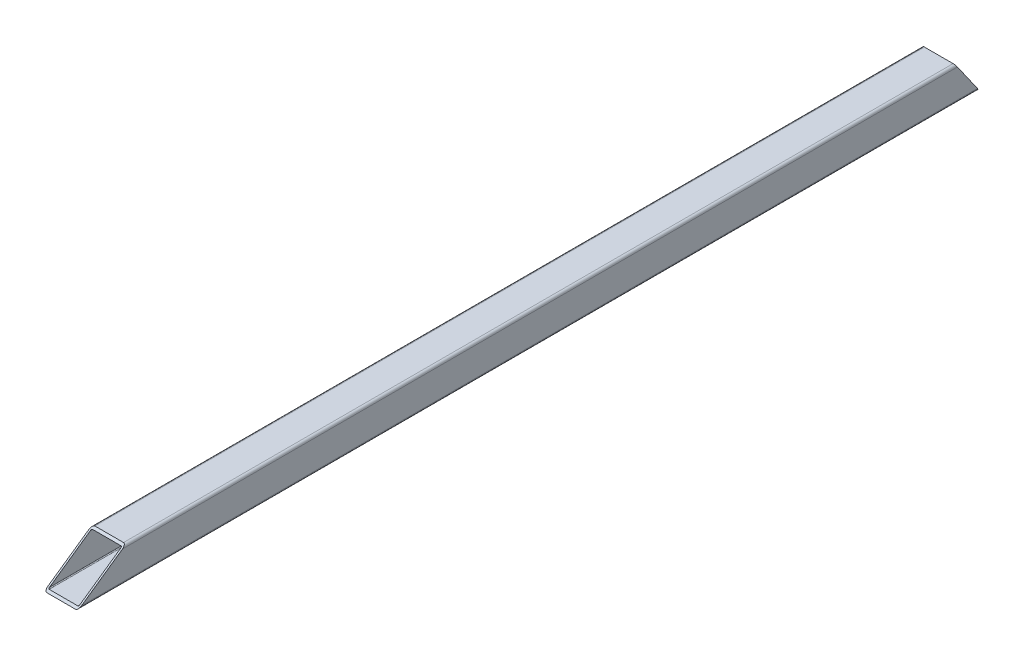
ISO-10303-21;
HEADER;
FILE_DESCRIPTION(('STEP AP214'),'2;1');
FILE_NAME('part.step','',(''),(''),'','','');
FILE_SCHEMA(('AUTOMOTIVE_DESIGN { 1 0 10303 214 1 1 1 1 }'));
ENDSEC;
DATA;
#1=APPLICATION_CONTEXT('core data for automotive mechanical design processes');
#2=APPLICATION_PROTOCOL_DEFINITION('international standard','automotive_design',2000,#1);
#3=PRODUCT_CONTEXT('',#1,'mechanical');
#4=PRODUCT('Part','Part','',(#3));
#5=PRODUCT_RELATED_PRODUCT_CATEGORY('part','',(#4));
#6=PRODUCT_DEFINITION_FORMATION('','',#4);
#7=PRODUCT_DEFINITION_CONTEXT('part definition',#1,'design');
#8=PRODUCT_DEFINITION('design','',#6,#7);
#9=PRODUCT_DEFINITION_SHAPE('','',#8);
#10=(LENGTH_UNIT() NAMED_UNIT(*) SI_UNIT(.MILLI.,.METRE.));
#11=(NAMED_UNIT(*) PLANE_ANGLE_UNIT() SI_UNIT($,.RADIAN.));
#12=(NAMED_UNIT(*) SI_UNIT($,.STERADIAN.) SOLID_ANGLE_UNIT());
#13=UNCERTAINTY_MEASURE_WITH_UNIT(LENGTH_MEASURE(1.E-05),#10,'distance_accuracy_value','');
#14=(GEOMETRIC_REPRESENTATION_CONTEXT(3) GLOBAL_UNCERTAINTY_ASSIGNED_CONTEXT((#13)) GLOBAL_UNIT_ASSIGNED_CONTEXT((#10,
#11,#12)) REPRESENTATION_CONTEXT('',''));
#15=CARTESIAN_POINT('',(0.,0.,0.));
#16=DIRECTION('',(0.,0.,1.));
#17=DIRECTION('',(1.,0.,0.));
#18=AXIS2_PLACEMENT_3D('',#15,#16,#17);
#19=CARTESIAN_POINT('',(3.,-3.,1070.));
#20=DIRECTION('',(0.,0.,-1.));
#21=DIRECTION('',(-1.,0.,0.));
#22=AXIS2_PLACEMENT_3D('',#19,#20,#21);
#23=CYLINDRICAL_SURFACE('',#22,3.);
#24=DIRECTION('',(0.,0.,-1.));
#25=VECTOR('',#24,1.);
#26=CARTESIAN_POINT('',(0.,-3.00000000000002,1070.));
#27=LINE('',#26,#25);
#28=CARTESIAN_POINT('',(0.,-2.99999999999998,1017.15852375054));
#29=VERTEX_POINT('',#28);
#30=CARTESIAN_POINT('',(0.,-3.00000000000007,25.9076789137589));
#31=VERTEX_POINT('',#30);
#32=EDGE_CURVE('E152',#29,#31,#27,.T.);
#33=ORIENTED_EDGE('',*,*,#32,.F.);
#34=CARTESIAN_POINT('',(3.,-3.,1017.15852375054));
#35=DIRECTION('',(0.,-0.819152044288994,-0.573576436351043));
#36=DIRECTION('',(0.,0.573576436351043,-0.819152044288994));
#37=AXIS2_PLACEMENT_3D('',#34,#35,#36);
#38=ELLIPSE('',#37,5.23034038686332,3.);
#39=CARTESIAN_POINT('',(3.00000000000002,0.,1012.87407973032));
#40=VERTEX_POINT('',#39);
#41=EDGE_CURVE('E136',#29,#40,#38,.T.);
#42=ORIENTED_EDGE('',*,*,#41,.T.);
#43=DIRECTION('',(0.,0.,-1.));
#44=VECTOR('',#43,1.);
#45=CARTESIAN_POINT('',(3.00000000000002,0.,1070.));
#46=LINE('',#45,#44);
#47=CARTESIAN_POINT('',(3.00000000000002,0.,28.0083015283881));
#48=VERTEX_POINT('',#47);
#49=EDGE_CURVE('E176',#40,#48,#46,.T.);
#50=ORIENTED_EDGE('',*,*,#49,.T.);
#51=CARTESIAN_POINT('',(3.,-3.,25.9076789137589));
#52=DIRECTION('',(0.,-0.573576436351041,0.819152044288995));
#53=DIRECTION('',(0.,-0.819152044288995,-0.573576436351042));
#54=AXIS2_PLACEMENT_3D('',#51,#52,#53);
#55=ELLIPSE('',#54,3.66232376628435,3.);
#56=EDGE_CURVE('E159',#48,#31,#55,.T.);
#57=ORIENTED_EDGE('',*,*,#56,.T.);
#58=EDGE_LOOP('',(#33,#42,#50,#57));
#59=FACE_BOUND('',#58,.T.);
#60=ADVANCED_FACE('F27',(#59),#23,.T.);
#61=CARTESIAN_POINT('',(0.,-3.00000000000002,1070.));
#62=DIRECTION('',(1.,0.,0.));
#63=DIRECTION('',(0.,1.,0.));
#64=AXIS2_PLACEMENT_3D('',#61,#62,#63);
#65=PLANE('',#64);
#66=DIRECTION('',(0.,0.,-1.));
#67=VECTOR('',#66,1.);
#68=CARTESIAN_POINT('',(0.,-37.,1070.));
#69=LINE('',#68,#67);
#70=CARTESIAN_POINT('',(0.,-37.,1065.71555597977));
#71=VERTEX_POINT('',#70);
#72=CARTESIAN_POINT('',(0.,-37.,2.10062261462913));
#73=VERTEX_POINT('',#72);
#74=EDGE_CURVE('E154',#71,#73,#69,.T.);
#75=ORIENTED_EDGE('',*,*,#74,.F.);
#76=DIRECTION('',(0.,-0.573576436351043,0.819152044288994));
#77=VECTOR('',#76,1.);
#78=CARTESIAN_POINT('',(0.,0.,1012.87407973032));
#79=LINE('',#78,#77);
#80=EDGE_CURVE('E139',#29,#71,#79,.T.);
#81=ORIENTED_EDGE('',*,*,#80,.F.);
#82=ORIENTED_EDGE('',*,*,#32,.T.);
#83=DIRECTION('',(0.,0.819152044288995,0.573576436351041));
#84=VECTOR('',#83,1.);
#85=CARTESIAN_POINT('',(0.,-40.,0.));
#86=LINE('',#85,#84);
#87=EDGE_CURVE('E145',#73,#31,#86,.T.);
#88=ORIENTED_EDGE('',*,*,#87,.F.);
#89=EDGE_LOOP('',(#75,#81,#82,#88));
#90=FACE_BOUND('',#89,.T.);
#91=ADVANCED_FACE('F150',(#90),#65,.F.);
#92=CARTESIAN_POINT('',(3.,-37.,1070.));
#93=DIRECTION('',(0.,0.,-1.));
#94=DIRECTION('',(-1.,0.,0.));
#95=AXIS2_PLACEMENT_3D('',#92,#93,#94);
#96=CYLINDRICAL_SURFACE('',#95,3.);
#97=DIRECTION('',(0.,0.,-1.));
#98=VECTOR('',#97,1.);
#99=CARTESIAN_POINT('',(3.00000000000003,-40.,1070.));
#100=LINE('',#99,#98);
#101=CARTESIAN_POINT('',(3.00000000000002,-40.,1070.));
#102=VERTEX_POINT('',#101);
#103=CARTESIAN_POINT('',(3.00000000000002,-40.,0.));
#104=VERTEX_POINT('',#103);
#105=EDGE_CURVE('E162',#102,#104,#100,.T.);
#106=ORIENTED_EDGE('',*,*,#105,.F.);
#107=CARTESIAN_POINT('',(3.,-37.,1065.71555597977));
#108=DIRECTION('',(0.,-0.819152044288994,-0.573576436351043));
#109=DIRECTION('',(0.,0.573576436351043,-0.819152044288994));
#110=AXIS2_PLACEMENT_3D('',#107,#108,#109);
#111=ELLIPSE('',#110,5.23034038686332,3.);
#112=EDGE_CURVE('E146',#102,#71,#111,.T.);
#113=ORIENTED_EDGE('',*,*,#112,.T.);
#114=ORIENTED_EDGE('',*,*,#74,.T.);
#115=CARTESIAN_POINT('',(3.,-37.,2.10062261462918));
#116=DIRECTION('',(0.,-0.573576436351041,0.819152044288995));
#117=DIRECTION('',(0.,-0.819152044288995,-0.573576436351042));
#118=AXIS2_PLACEMENT_3D('',#115,#116,#117);
#119=ELLIPSE('',#118,3.66232376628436,3.);
#120=EDGE_CURVE('E200',#73,#104,#119,.T.);
#121=ORIENTED_EDGE('',*,*,#120,.T.);
#122=EDGE_LOOP('',(#106,#113,#114,#121));
#123=FACE_BOUND('',#122,.T.);
#124=ADVANCED_FACE('F275',(#123),#96,.T.);
#125=CARTESIAN_POINT('',(3.00000000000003,-40.,1070.));
#126=DIRECTION('',(0.,1.,0.));
#127=DIRECTION('',(0.,0.,1.));
#128=AXIS2_PLACEMENT_3D('',#125,#126,#127);
#129=PLANE('',#128);
#130=DIRECTION('',(1.,0.,0.));
#131=VECTOR('',#130,1.);
#132=CARTESIAN_POINT('',(3.00000000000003,-40.,0.));
#133=LINE('',#132,#131);
#134=CARTESIAN_POINT('',(37.,-40.,0.));
#135=VERTEX_POINT('',#134);
#136=EDGE_CURVE('E180',#104,#135,#133,.T.);
#137=ORIENTED_EDGE('',*,*,#136,.T.);
#138=DIRECTION('',(0.,0.,-1.));
#139=VECTOR('',#138,1.);
#140=CARTESIAN_POINT('',(37.,-40.,1070.));
#141=LINE('',#140,#139);
#142=CARTESIAN_POINT('',(37.,-40.,1070.));
#143=VERTEX_POINT('',#142);
#144=EDGE_CURVE('E167',#143,#135,#141,.T.);
#145=ORIENTED_EDGE('',*,*,#144,.F.);
#146=DIRECTION('',(1.,0.,0.));
#147=VECTOR('',#146,1.);
#148=CARTESIAN_POINT('',(3.00000000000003,-40.,1070.));
#149=LINE('',#148,#147);
#150=EDGE_CURVE('E178',#102,#143,#149,.T.);
#151=ORIENTED_EDGE('',*,*,#150,.F.);
#152=ORIENTED_EDGE('',*,*,#105,.T.);
#153=EDGE_LOOP('',(#137,#145,#151,#152));
#154=FACE_BOUND('',#153,.T.);
#155=ADVANCED_FACE('F271',(#154),#129,.F.);
#156=CARTESIAN_POINT('',(37.,-37.,1070.));
#157=DIRECTION('',(0.,0.,-1.));
#158=DIRECTION('',(-1.,0.,0.));
#159=AXIS2_PLACEMENT_3D('',#156,#157,#158);
#160=CYLINDRICAL_SURFACE('',#159,3.);
#161=DIRECTION('',(0.,0.,-1.));
#162=VECTOR('',#161,1.);
#163=CARTESIAN_POINT('',(40.,-37.,1070.));
#164=LINE('',#163,#162);
#165=CARTESIAN_POINT('',(40.,-37.,1065.71555597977));
#166=VERTEX_POINT('',#165);
#167=CARTESIAN_POINT('',(40.,-37.,2.10062261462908));
#168=VERTEX_POINT('',#167);
#169=EDGE_CURVE('E170',#166,#168,#164,.T.);
#170=ORIENTED_EDGE('',*,*,#169,.F.);
#171=CARTESIAN_POINT('',(37.,-37.,1065.71555597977));
#172=DIRECTION('',(0.,-0.819152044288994,-0.573576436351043));
#173=DIRECTION('',(0.,0.573576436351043,-0.819152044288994));
#174=AXIS2_PLACEMENT_3D('',#171,#172,#173);
#175=ELLIPSE('',#174,5.23034038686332,3.);
#176=EDGE_CURVE('E238',#166,#143,#175,.T.);
#177=ORIENTED_EDGE('',*,*,#176,.T.);
#178=ORIENTED_EDGE('',*,*,#144,.T.);
#179=CARTESIAN_POINT('',(37.,-37.,2.10062261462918));
#180=DIRECTION('',(0.,-0.573576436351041,0.819152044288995));
#181=DIRECTION('',(0.,-0.819152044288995,-0.573576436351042));
#182=AXIS2_PLACEMENT_3D('',#179,#180,#181);
#183=ELLIPSE('',#182,3.66232376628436,3.);
#184=EDGE_CURVE('E203',#135,#168,#183,.T.);
#185=ORIENTED_EDGE('',*,*,#184,.T.);
#186=EDGE_LOOP('',(#170,#177,#178,#185));
#187=FACE_BOUND('',#186,.T.);
#188=ADVANCED_FACE('F263',(#187),#160,.T.);
#189=CARTESIAN_POINT('',(40.,-3.00000000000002,1070.));
#190=DIRECTION('',(-1.,0.,0.));
#191=DIRECTION('',(0.,0.,1.));
#192=AXIS2_PLACEMENT_3D('',#189,#190,#191);
#193=PLANE('',#192);
#194=DIRECTION('',(0.,0.,-1.));
#195=VECTOR('',#194,1.);
#196=CARTESIAN_POINT('',(40.,-3.00000000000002,1070.));
#197=LINE('',#196,#195);
#198=CARTESIAN_POINT('',(40.,-3.,1017.15852375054));
#199=VERTEX_POINT('',#198);
#200=CARTESIAN_POINT('',(40.,-2.99999999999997,25.9076789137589));
#201=VERTEX_POINT('',#200);
#202=EDGE_CURVE('E172',#199,#201,#197,.T.);
#203=ORIENTED_EDGE('',*,*,#202,.F.);
#204=DIRECTION('',(0.,-0.573576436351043,0.819152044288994));
#205=VECTOR('',#204,1.);
#206=CARTESIAN_POINT('',(40.,0.,1012.87407973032));
#207=LINE('',#206,#205);
#208=EDGE_CURVE('E155',#199,#166,#207,.T.);
#209=ORIENTED_EDGE('',*,*,#208,.T.);
#210=ORIENTED_EDGE('',*,*,#169,.T.);
#211=DIRECTION('',(0.,0.819152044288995,0.573576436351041));
#212=VECTOR('',#211,1.);
#213=CARTESIAN_POINT('',(40.,-40.,0.));
#214=LINE('',#213,#212);
#215=EDGE_CURVE('E233',#168,#201,#214,.T.);
#216=ORIENTED_EDGE('',*,*,#215,.T.);
#217=EDGE_LOOP('',(#203,#209,#210,#216));
#218=FACE_BOUND('',#217,.T.);
#219=ADVANCED_FACE('F260',(#218),#193,.F.);
#220=CARTESIAN_POINT('',(37.,-3.,1070.));
#221=DIRECTION('',(0.,0.,-1.));
#222=DIRECTION('',(-1.,0.,0.));
#223=AXIS2_PLACEMENT_3D('',#220,#221,#222);
#224=CYLINDRICAL_SURFACE('',#223,3.);
#225=DIRECTION('',(0.,0.,-1.));
#226=VECTOR('',#225,1.);
#227=CARTESIAN_POINT('',(37.,0.,1070.));
#228=LINE('',#227,#226);
#229=CARTESIAN_POINT('',(37.,0.,1012.87407973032));
#230=VERTEX_POINT('',#229);
#231=CARTESIAN_POINT('',(37.,0.,28.0083015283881));
#232=VERTEX_POINT('',#231);
#233=EDGE_CURVE('E174',#230,#232,#228,.T.);
#234=ORIENTED_EDGE('',*,*,#233,.F.);
#235=CARTESIAN_POINT('',(37.,-3.,1017.15852375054));
#236=DIRECTION('',(0.,-0.819152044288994,-0.573576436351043));
#237=DIRECTION('',(0.,0.573576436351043,-0.819152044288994));
#238=AXIS2_PLACEMENT_3D('',#235,#236,#237);
#239=ELLIPSE('',#238,5.23034038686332,3.);
#240=EDGE_CURVE('E41',#230,#199,#239,.T.);
#241=ORIENTED_EDGE('',*,*,#240,.T.);
#242=ORIENTED_EDGE('',*,*,#202,.T.);
#243=CARTESIAN_POINT('',(37.,-3.,25.9076789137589));
#244=DIRECTION('',(0.,-0.573576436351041,0.819152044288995));
#245=DIRECTION('',(0.,-0.819152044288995,-0.573576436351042));
#246=AXIS2_PLACEMENT_3D('',#243,#244,#245);
#247=ELLIPSE('',#246,3.66232376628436,3.);
#248=EDGE_CURVE('E206',#201,#232,#247,.T.);
#249=ORIENTED_EDGE('',*,*,#248,.T.);
#250=EDGE_LOOP('',(#234,#241,#242,#249));
#251=FACE_BOUND('',#250,.T.);
#252=ADVANCED_FACE('F280',(#251),#224,.T.);
#253=CARTESIAN_POINT('',(3.00000000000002,0.,1070.));
#254=DIRECTION('',(0.,-1.,0.));
#255=DIRECTION('',(0.,0.,-1.));
#256=AXIS2_PLACEMENT_3D('',#253,#254,#255);
#257=PLANE('',#256);
#258=ORIENTED_EDGE('',*,*,#49,.F.);
#259=DIRECTION('',(-1.,0.,0.));
#260=VECTOR('',#259,1.);
#261=CARTESIAN_POINT('',(40.,0.,1012.87407973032));
#262=LINE('',#261,#260);
#263=EDGE_CURVE('E141',#230,#40,#262,.T.);
#264=ORIENTED_EDGE('',*,*,#263,.F.);
#265=ORIENTED_EDGE('',*,*,#233,.T.);
#266=DIRECTION('',(-1.,0.,0.));
#267=VECTOR('',#266,1.);
#268=CARTESIAN_POINT('',(40.,0.,28.0083015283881));
#269=LINE('',#268,#267);
#270=EDGE_CURVE('E230',#232,#48,#269,.T.);
#271=ORIENTED_EDGE('',*,*,#270,.T.);
#272=EDGE_LOOP('',(#258,#264,#265,#271));
#273=FACE_BOUND('',#272,.T.);
#274=ADVANCED_FACE('F277',(#273),#257,.F.);
#275=CARTESIAN_POINT('',(3.,-3.,1070.));
#276=DIRECTION('',(0.,0.,-1.));
#277=DIRECTION('',(-1.,0.,0.));
#278=AXIS2_PLACEMENT_3D('',#275,#276,#277);
#279=CYLINDRICAL_SURFACE('',#278,1.);
#280=CARTESIAN_POINT('',(3.,-3.,1017.15852375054));
#281=DIRECTION('',(0.,-0.819152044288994,-0.573576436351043));
#282=DIRECTION('',(0.,0.573576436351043,-0.819152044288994));
#283=AXIS2_PLACEMENT_3D('',#280,#281,#282);
#284=ELLIPSE('',#283,1.74344679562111,1.);
#285=CARTESIAN_POINT('',(2.,-3.00000000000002,1017.15852375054));
#286=VERTEX_POINT('',#285);
#287=CARTESIAN_POINT('',(3.00000000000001,-2.,1015.7303757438));
#288=VERTEX_POINT('',#287);
#289=EDGE_CURVE('E48',#286,#288,#284,.T.);
#290=ORIENTED_EDGE('',*,*,#289,.F.);
#291=DIRECTION('',(0.,0.,-1.));
#292=VECTOR('',#291,1.);
#293=CARTESIAN_POINT('',(2.,-3.00000000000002,1070.));
#294=LINE('',#293,#292);
#295=CARTESIAN_POINT('',(2.,-3.,25.9076789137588));
#296=VERTEX_POINT('',#295);
#297=EDGE_CURVE('E183',#286,#296,#294,.T.);
#298=ORIENTED_EDGE('',*,*,#297,.T.);
#299=CARTESIAN_POINT('',(3.,-3.,25.9076789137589));
#300=DIRECTION('',(0.,-0.573576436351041,0.819152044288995));
#301=DIRECTION('',(0.,-0.819152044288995,-0.573576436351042));
#302=AXIS2_PLACEMENT_3D('',#299,#300,#301);
#303=ELLIPSE('',#302,1.22077458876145,1.);
#304=CARTESIAN_POINT('',(3.00000000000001,-2.,26.6078864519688));
#305=VERTEX_POINT('',#304);
#306=EDGE_CURVE('E209',#305,#296,#303,.T.);
#307=ORIENTED_EDGE('',*,*,#306,.F.);
#308=DIRECTION('',(0.,0.,-1.));
#309=VECTOR('',#308,1.);
#310=CARTESIAN_POINT('',(3.00000000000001,-2.,1070.));
#311=LINE('',#310,#309);
#312=EDGE_CURVE('E197',#288,#305,#311,.T.);
#313=ORIENTED_EDGE('',*,*,#312,.F.);
#314=EDGE_LOOP('',(#290,#298,#307,#313));
#315=FACE_BOUND('',#314,.T.);
#316=ADVANCED_FACE('F287',(#315),#279,.F.);
#317=CARTESIAN_POINT('',(2.,-3.00000000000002,1070.));
#318=DIRECTION('',(1.,0.,0.));
#319=DIRECTION('',(0.,1.,0.));
#320=AXIS2_PLACEMENT_3D('',#317,#318,#319);
#321=PLANE('',#320);
#322=DIRECTION('',(0.,0.573576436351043,-0.819152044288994));
#323=VECTOR('',#322,1.);
#324=CARTESIAN_POINT('',(2.,-27.827372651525,1052.61568651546));
#325=LINE('',#324,#323);
#326=CARTESIAN_POINT('',(2.,-37.,1065.71555597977));
#327=VERTEX_POINT('',#326);
#328=EDGE_CURVE('E243',#327,#286,#325,.T.);
#329=ORIENTED_EDGE('',*,*,#328,.F.);
#330=DIRECTION('',(0.,0.,-1.));
#331=VECTOR('',#330,1.);
#332=CARTESIAN_POINT('',(2.,-37.,1070.));
#333=LINE('',#332,#331);
#334=CARTESIAN_POINT('',(2.,-37.,2.10062261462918));
#335=VERTEX_POINT('',#334);
#336=EDGE_CURVE('E185',#327,#335,#333,.T.);
#337=ORIENTED_EDGE('',*,*,#336,.T.);
#338=DIRECTION('',(0.,-0.819152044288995,-0.573576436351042));
#339=VECTOR('',#338,1.);
#340=CARTESIAN_POINT('',(1.99999999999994,487.562924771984,369.403536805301));
#341=LINE('',#340,#339);
#342=EDGE_CURVE('E212',#296,#335,#341,.T.);
#343=ORIENTED_EDGE('',*,*,#342,.F.);
#344=ORIENTED_EDGE('',*,*,#297,.F.);
#345=EDGE_LOOP('',(#329,#337,#343,#344));
#346=FACE_BOUND('',#345,.T.);
#347=ADVANCED_FACE('F362',(#346),#321,.T.);
#348=CARTESIAN_POINT('',(3.,-37.,1070.));
#349=DIRECTION('',(0.,0.,-1.));
#350=DIRECTION('',(-1.,0.,0.));
#351=AXIS2_PLACEMENT_3D('',#348,#349,#350);
#352=CYLINDRICAL_SURFACE('',#351,1.);
#353=CARTESIAN_POINT('',(3.,-37.,1065.71555597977));
#354=DIRECTION('',(0.,-0.819152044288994,-0.573576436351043));
#355=DIRECTION('',(0.,0.573576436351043,-0.819152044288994));
#356=AXIS2_PLACEMENT_3D('',#353,#354,#355);
#357=ELLIPSE('',#356,1.74344679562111,1.);
#358=CARTESIAN_POINT('',(3.00000000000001,-38.,1067.14370398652));
#359=VERTEX_POINT('',#358);
#360=EDGE_CURVE('E245',#359,#327,#357,.T.);
#361=ORIENTED_EDGE('',*,*,#360,.F.);
#362=DIRECTION('',(0.,0.,-1.));
#363=VECTOR('',#362,1.);
#364=CARTESIAN_POINT('',(3.00000000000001,-38.,1070.));
#365=LINE('',#364,#363);
#366=CARTESIAN_POINT('',(3.00000000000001,-38.,1.4004150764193));
#367=VERTEX_POINT('',#366);
#368=EDGE_CURVE('E187',#359,#367,#365,.T.);
#369=ORIENTED_EDGE('',*,*,#368,.T.);
#370=CARTESIAN_POINT('',(3.,-37.,2.10062261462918));
#371=DIRECTION('',(0.,-0.573576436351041,0.819152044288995));
#372=DIRECTION('',(0.,-0.819152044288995,-0.573576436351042));
#373=AXIS2_PLACEMENT_3D('',#370,#371,#372);
#374=ELLIPSE('',#373,1.22077458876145,1.);
#375=EDGE_CURVE('E215',#335,#367,#374,.T.);
#376=ORIENTED_EDGE('',*,*,#375,.F.);
#377=ORIENTED_EDGE('',*,*,#336,.F.);
#378=EDGE_LOOP('',(#361,#369,#376,#377));
#379=FACE_BOUND('',#378,.T.);
#380=ADVANCED_FACE('F358',(#379),#352,.F.);
#381=CARTESIAN_POINT('',(3.00000000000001,-38.,1070.));
#382=DIRECTION('',(0.,1.,0.));
#383=DIRECTION('',(0.,0.,1.));
#384=AXIS2_PLACEMENT_3D('',#381,#382,#383);
#385=PLANE('',#384);
#386=DIRECTION('',(-1.,0.,0.));
#387=VECTOR('',#386,1.);
#388=CARTESIAN_POINT('',(3.00000000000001,-38.,1067.14370398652));
#389=LINE('',#388,#387);
#390=CARTESIAN_POINT('',(37.,-38.,1067.14370398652));
#391=VERTEX_POINT('',#390);
#392=EDGE_CURVE('E247',#391,#359,#389,.T.);
#393=ORIENTED_EDGE('',*,*,#392,.F.);
#394=DIRECTION('',(0.,0.,-1.));
#395=VECTOR('',#394,1.);
#396=CARTESIAN_POINT('',(37.,-38.,1070.));
#397=LINE('',#396,#395);
#398=CARTESIAN_POINT('',(37.,-38.,1.40041507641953));
#399=VERTEX_POINT('',#398);
#400=EDGE_CURVE('E189',#391,#399,#397,.T.);
#401=ORIENTED_EDGE('',*,*,#400,.T.);
#402=DIRECTION('',(1.,0.,0.));
#403=VECTOR('',#402,1.);
#404=CARTESIAN_POINT('',(2.99999999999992,-38.,1.4004150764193));
#405=LINE('',#404,#403);
#406=EDGE_CURVE('E218',#367,#399,#405,.T.);
#407=ORIENTED_EDGE('',*,*,#406,.F.);
#408=ORIENTED_EDGE('',*,*,#368,.F.);
#409=EDGE_LOOP('',(#393,#401,#407,#408));
#410=FACE_BOUND('',#409,.T.);
#411=ADVANCED_FACE('F354',(#410),#385,.T.);
#412=CARTESIAN_POINT('',(37.,-37.,1070.));
#413=DIRECTION('',(0.,0.,-1.));
#414=DIRECTION('',(-1.,0.,0.));
#415=AXIS2_PLACEMENT_3D('',#412,#413,#414);
#416=CYLINDRICAL_SURFACE('',#415,1.);
#417=CARTESIAN_POINT('',(37.,-37.,1065.71555597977));
#418=DIRECTION('',(0.,-0.819152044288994,-0.573576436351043));
#419=DIRECTION('',(0.,0.573576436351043,-0.819152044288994));
#420=AXIS2_PLACEMENT_3D('',#417,#418,#419);
#421=ELLIPSE('',#420,1.74344679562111,1.);
#422=CARTESIAN_POINT('',(38.,-37.,1065.71555597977));
#423=VERTEX_POINT('',#422);
#424=EDGE_CURVE('E249',#423,#391,#421,.T.);
#425=ORIENTED_EDGE('',*,*,#424,.F.);
#426=DIRECTION('',(0.,0.,-1.));
#427=VECTOR('',#426,1.);
#428=CARTESIAN_POINT('',(38.,-37.,1070.));
#429=LINE('',#428,#427);
#430=CARTESIAN_POINT('',(38.,-37.,2.10062261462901));
#431=VERTEX_POINT('',#430);
#432=EDGE_CURVE('E191',#423,#431,#429,.T.);
#433=ORIENTED_EDGE('',*,*,#432,.T.);
#434=CARTESIAN_POINT('',(37.,-37.,2.10062261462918));
#435=DIRECTION('',(0.,-0.573576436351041,0.819152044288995));
#436=DIRECTION('',(0.,-0.819152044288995,-0.573576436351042));
#437=AXIS2_PLACEMENT_3D('',#434,#435,#436);
#438=ELLIPSE('',#437,1.22077458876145,1.);
#439=EDGE_CURVE('E221',#399,#431,#438,.T.);
#440=ORIENTED_EDGE('',*,*,#439,.F.);
#441=ORIENTED_EDGE('',*,*,#400,.F.);
#442=EDGE_LOOP('',(#425,#433,#440,#441));
#443=FACE_BOUND('',#442,.T.);
#444=ADVANCED_FACE('F350',(#443),#416,.F.);
#445=CARTESIAN_POINT('',(38.,-3.00000000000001,1070.));
#446=DIRECTION('',(-1.,0.,0.));
#447=DIRECTION('',(0.,0.,1.));
#448=AXIS2_PLACEMENT_3D('',#445,#446,#447);
#449=PLANE('',#448);
#450=DIRECTION('',(0.,-0.573576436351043,0.819152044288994));
#451=VECTOR('',#450,1.);
#452=CARTESIAN_POINT('',(38.,-27.827372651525,1052.61568651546));
#453=LINE('',#452,#451);
#454=CARTESIAN_POINT('',(38.,-3.00000000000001,1017.15852375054));
#455=VERTEX_POINT('',#454);
#456=EDGE_CURVE('E251',#455,#423,#453,.T.);
#457=ORIENTED_EDGE('',*,*,#456,.F.);
#458=DIRECTION('',(0.,0.,-1.));
#459=VECTOR('',#458,1.);
#460=CARTESIAN_POINT('',(38.,-3.00000000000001,1070.));
#461=LINE('',#460,#459);
#462=CARTESIAN_POINT('',(38.,-3.00000000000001,25.9076789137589));
#463=VERTEX_POINT('',#462);
#464=EDGE_CURVE('E193',#455,#463,#461,.T.);
#465=ORIENTED_EDGE('',*,*,#464,.T.);
#466=DIRECTION('',(0.,0.819152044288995,0.573576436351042));
#467=VECTOR('',#466,1.);
#468=CARTESIAN_POINT('',(38.,487.562924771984,369.403536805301));
#469=LINE('',#468,#467);
#470=EDGE_CURVE('E224',#431,#463,#469,.T.);
#471=ORIENTED_EDGE('',*,*,#470,.F.);
#472=ORIENTED_EDGE('',*,*,#432,.F.);
#473=EDGE_LOOP('',(#457,#465,#471,#472));
#474=FACE_BOUND('',#473,.T.);
#475=ADVANCED_FACE('F328',(#474),#449,.T.);
#476=CARTESIAN_POINT('',(37.,-3.,1070.));
#477=DIRECTION('',(0.,0.,-1.));
#478=DIRECTION('',(-1.,0.,0.));
#479=AXIS2_PLACEMENT_3D('',#476,#477,#478);
#480=CYLINDRICAL_SURFACE('',#479,1.);
#481=CARTESIAN_POINT('',(37.,-3.,1017.15852375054));
#482=DIRECTION('',(0.,-0.819152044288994,-0.573576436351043));
#483=DIRECTION('',(0.,0.573576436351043,-0.819152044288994));
#484=AXIS2_PLACEMENT_3D('',#481,#482,#483);
#485=ELLIPSE('',#484,1.74344679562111,1.);
#486=CARTESIAN_POINT('',(37.,-2.,1015.7303757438));
#487=VERTEX_POINT('',#486);
#488=EDGE_CURVE('E253',#487,#455,#485,.T.);
#489=ORIENTED_EDGE('',*,*,#488,.F.);
#490=DIRECTION('',(0.,0.,-1.));
#491=VECTOR('',#490,1.);
#492=CARTESIAN_POINT('',(37.,-2.,1070.));
#493=LINE('',#492,#491);
#494=CARTESIAN_POINT('',(37.,-2.,26.6078864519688));
#495=VERTEX_POINT('',#494);
#496=EDGE_CURVE('E195',#487,#495,#493,.T.);
#497=ORIENTED_EDGE('',*,*,#496,.T.);
#498=CARTESIAN_POINT('',(37.,-3.,25.9076789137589));
#499=DIRECTION('',(0.,-0.573576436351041,0.819152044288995));
#500=DIRECTION('',(0.,-0.819152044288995,-0.573576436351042));
#501=AXIS2_PLACEMENT_3D('',#498,#499,#500);
#502=ELLIPSE('',#501,1.22077458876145,1.);
#503=EDGE_CURVE('E227',#463,#495,#502,.T.);
#504=ORIENTED_EDGE('',*,*,#503,.F.);
#505=ORIENTED_EDGE('',*,*,#464,.F.);
#506=EDGE_LOOP('',(#489,#497,#504,#505));
#507=FACE_BOUND('',#506,.T.);
#508=ADVANCED_FACE('F322',(#507),#480,.F.);
#509=CARTESIAN_POINT('',(3.00000000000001,-2.,1070.));
#510=DIRECTION('',(0.,-1.,0.));
#511=DIRECTION('',(0.,0.,-1.));
#512=AXIS2_PLACEMENT_3D('',#509,#510,#511);
#513=PLANE('',#512);
#514=DIRECTION('',(1.,0.,0.));
#515=VECTOR('',#514,1.);
#516=CARTESIAN_POINT('',(3.00000000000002,-2.,1015.7303757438));
#517=LINE('',#516,#515);
#518=EDGE_CURVE('E11',#288,#487,#517,.T.);
#519=ORIENTED_EDGE('',*,*,#518,.F.);
#520=ORIENTED_EDGE('',*,*,#312,.T.);
#521=DIRECTION('',(-1.,0.,0.));
#522=VECTOR('',#521,1.);
#523=CARTESIAN_POINT('',(2.99999999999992,-2.,26.6078864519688));
#524=LINE('',#523,#522);
#525=EDGE_CURVE('E34',#495,#305,#524,.T.);
#526=ORIENTED_EDGE('',*,*,#525,.F.);
#527=ORIENTED_EDGE('',*,*,#496,.F.);
#528=EDGE_LOOP('',(#519,#520,#526,#527));
#529=FACE_BOUND('',#528,.T.);
#530=ADVANCED_FACE('F327',(#529),#513,.T.);
#531=CARTESIAN_POINT('',(40.,-40.,0.));
#532=DIRECTION('',(0.,-0.573576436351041,0.819152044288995));
#533=DIRECTION('',(0.,-0.819152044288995,-0.573576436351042));
#534=AXIS2_PLACEMENT_3D('',#531,#532,#533);
#535=PLANE('',#534);
#536=ORIENTED_EDGE('',*,*,#306,.T.);
#537=ORIENTED_EDGE('',*,*,#342,.T.);
#538=ORIENTED_EDGE('',*,*,#375,.T.);
#539=ORIENTED_EDGE('',*,*,#406,.T.);
#540=ORIENTED_EDGE('',*,*,#439,.T.);
#541=ORIENTED_EDGE('',*,*,#470,.T.);
#542=ORIENTED_EDGE('',*,*,#503,.T.);
#543=ORIENTED_EDGE('',*,*,#525,.T.);
#544=EDGE_LOOP('',(#536,#537,#538,#539,#540,#541,#542,#543));
#545=FACE_BOUND('',#544,.T.);
#546=ORIENTED_EDGE('',*,*,#270,.F.);
#547=ORIENTED_EDGE('',*,*,#248,.F.);
#548=ORIENTED_EDGE('',*,*,#215,.F.);
#549=ORIENTED_EDGE('',*,*,#184,.F.);
#550=ORIENTED_EDGE('',*,*,#136,.F.);
#551=ORIENTED_EDGE('',*,*,#120,.F.);
#552=ORIENTED_EDGE('',*,*,#87,.T.);
#553=ORIENTED_EDGE('',*,*,#56,.F.);
#554=EDGE_LOOP('',(#546,#547,#548,#549,#550,#551,#552,#553));
#555=FACE_BOUND('',#554,.T.);
#556=ADVANCED_FACE('F267',(#545,#555),#535,.F.);
#557=CARTESIAN_POINT('',(40.,0.,1012.87407973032));
#558=DIRECTION('',(0.,-0.819152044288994,-0.573576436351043));
#559=DIRECTION('',(0.,0.573576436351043,-0.819152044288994));
#560=AXIS2_PLACEMENT_3D('',#557,#558,#559);
#561=PLANE('',#560);
#562=ORIENTED_EDGE('',*,*,#289,.T.);
#563=ORIENTED_EDGE('',*,*,#518,.T.);
#564=ORIENTED_EDGE('',*,*,#488,.T.);
#565=ORIENTED_EDGE('',*,*,#456,.T.);
#566=ORIENTED_EDGE('',*,*,#424,.T.);
#567=ORIENTED_EDGE('',*,*,#392,.T.);
#568=ORIENTED_EDGE('',*,*,#360,.T.);
#569=ORIENTED_EDGE('',*,*,#328,.T.);
#570=EDGE_LOOP('',(#562,#563,#564,#565,#566,#567,#568,#569));
#571=FACE_BOUND('',#570,.T.);
#572=ORIENTED_EDGE('',*,*,#80,.T.);
#573=ORIENTED_EDGE('',*,*,#112,.F.);
#574=ORIENTED_EDGE('',*,*,#150,.T.);
#575=ORIENTED_EDGE('',*,*,#176,.F.);
#576=ORIENTED_EDGE('',*,*,#208,.F.);
#577=ORIENTED_EDGE('',*,*,#240,.F.);
#578=ORIENTED_EDGE('',*,*,#263,.T.);
#579=ORIENTED_EDGE('',*,*,#41,.F.);
#580=EDGE_LOOP('',(#572,#573,#574,#575,#576,#577,#578,#579));
#581=FACE_BOUND('',#580,.T.);
#582=ADVANCED_FACE('F138',(#571,#581),#561,.F.);
#583=CLOSED_SHELL('',(#60,#91,#124,#155,#188,#219,#252,#274,#316,#347,#380,#411,#444,#475,#508,
#530,#556,#582));
#584=MANIFOLD_SOLID_BREP('B2',#583);
#585=ADVANCED_BREP_SHAPE_REPRESENTATION('',(#18,#584),#14);
#586=SHAPE_DEFINITION_REPRESENTATION(#9,#585);
ENDSEC;
END-ISO-10303-21;
